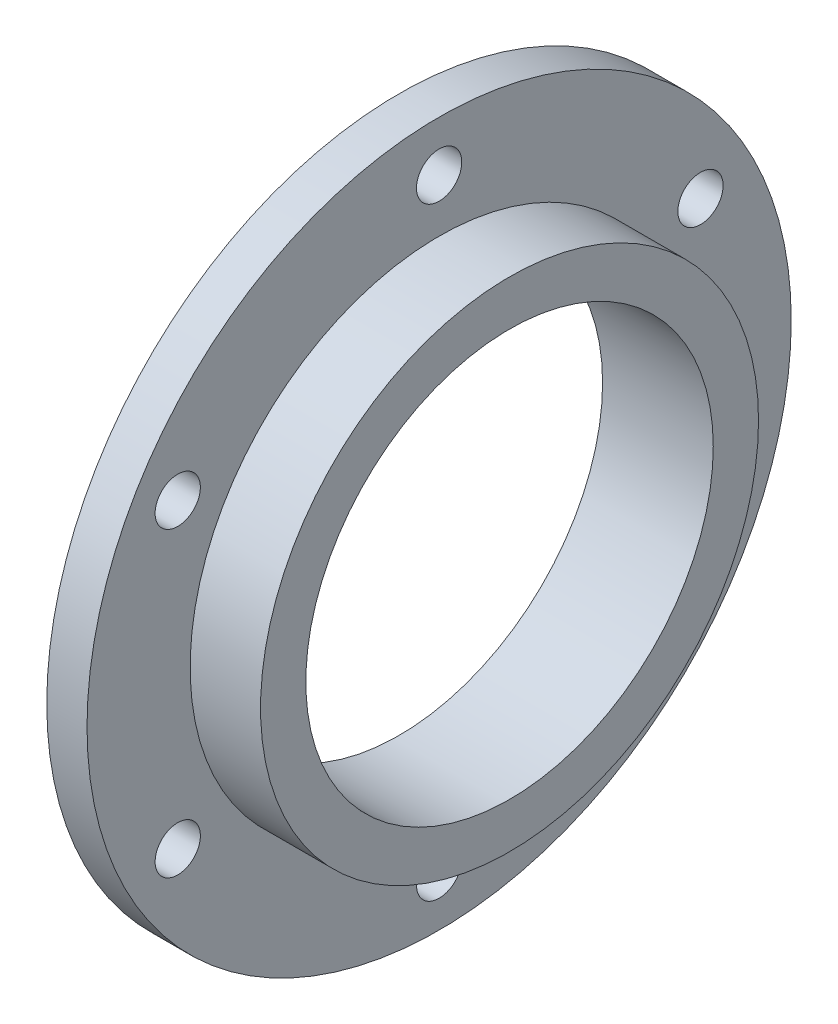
from build123d import *

# Parameters (mm, degrees)
SKETCH2_R          = 4.5
CUT_EXTRUDE1_DEPTH = 10
CIRPATTERN1_COUNT  = 6


with BuildPart() as part:
    # Sketch1 → Revolve1 (revolve)
    with BuildSketch(Plane.XY, mode=Mode.PRIVATE) as revolve1_sk:
        Polygon((-22, 70), (-14, 70), (-14, 49.5), (0, 49.5), (0, 40.5), (-22, 40.5), align=None)
    revolve(revolve1_sk.sketch.rotate(Axis((0, 0, 0), (-1, 0, 0)), 90), axis=Axis((0, 0, 0), (-1, 0, 0)))

    # Sketch2 → Cut-Extrude1 (cut)
    with BuildSketch(Plane.ZY.offset(22)):
        with Locations((0, 60)):
            Circle(SKETCH2_R)
    cut_extrude1 = extrude(amount=-CUT_EXTRUDE1_DEPTH, mode=Mode.SUBTRACT)

    # CirPattern1: Cut-Extrude1 ×6 about axis
    cirpattern1_axis = Axis((0, 0, 0), (1, 0, 0))
    for i in range(1, CIRPATTERN1_COUNT):
        add(cut_extrude1.rotate(cirpattern1_axis, i * 360 / CIRPATTERN1_COUNT), mode=Mode.SUBTRACT)


solid = part.part
